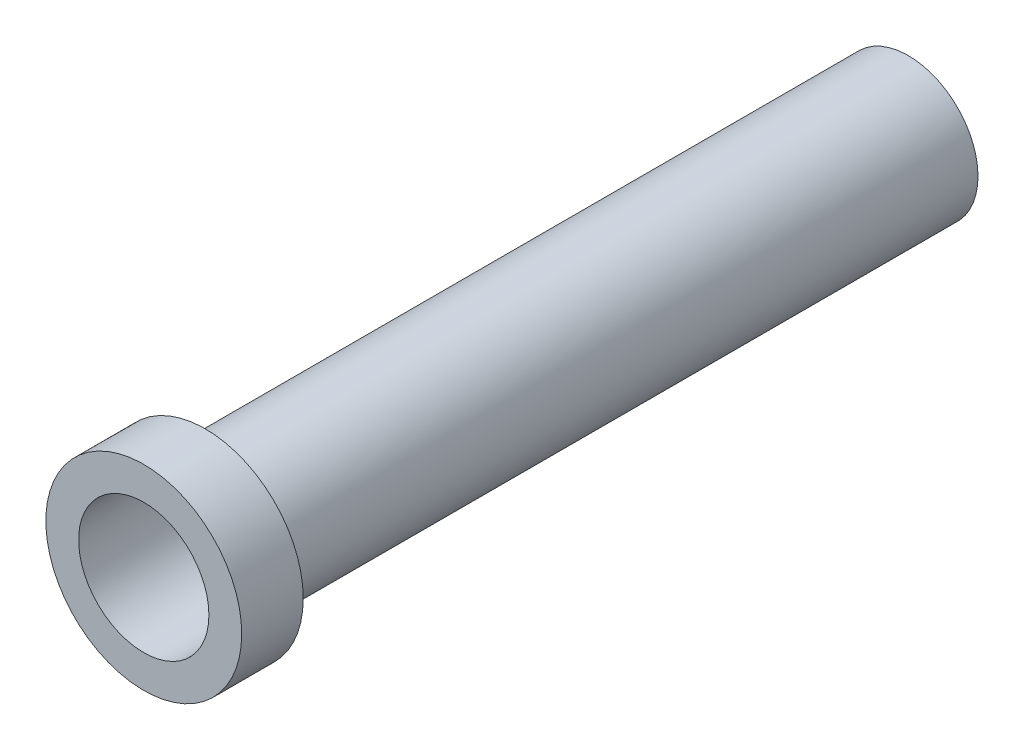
ISO-10303-21;
HEADER;
FILE_DESCRIPTION(('STEP AP214'),'2;1');
FILE_NAME('part.step','',(''),(''),'','','');
FILE_SCHEMA(('AUTOMOTIVE_DESIGN { 1 0 10303 214 1 1 1 1 }'));
ENDSEC;
DATA;
#1=APPLICATION_CONTEXT('core data for automotive mechanical design processes');
#2=APPLICATION_PROTOCOL_DEFINITION('international standard','automotive_design',2000,#1);
#3=PRODUCT_CONTEXT('',#1,'mechanical');
#4=PRODUCT('Part','Part','',(#3));
#5=PRODUCT_RELATED_PRODUCT_CATEGORY('part','',(#4));
#6=PRODUCT_DEFINITION_FORMATION('','',#4);
#7=PRODUCT_DEFINITION_CONTEXT('part definition',#1,'design');
#8=PRODUCT_DEFINITION('design','',#6,#7);
#9=PRODUCT_DEFINITION_SHAPE('','',#8);
#10=(LENGTH_UNIT() NAMED_UNIT(*) SI_UNIT(.MILLI.,.METRE.));
#11=(NAMED_UNIT(*) PLANE_ANGLE_UNIT() SI_UNIT($,.RADIAN.));
#12=(NAMED_UNIT(*) SI_UNIT($,.STERADIAN.) SOLID_ANGLE_UNIT());
#13=UNCERTAINTY_MEASURE_WITH_UNIT(LENGTH_MEASURE(1.E-05),#10,'distance_accuracy_value','');
#14=(GEOMETRIC_REPRESENTATION_CONTEXT(3) GLOBAL_UNCERTAINTY_ASSIGNED_CONTEXT((#13)) GLOBAL_UNIT_ASSIGNED_CONTEXT((#10,
#11,#12)) REPRESENTATION_CONTEXT('',''));
#15=CARTESIAN_POINT('',(0.,0.,0.));
#16=DIRECTION('',(0.,0.,1.));
#17=DIRECTION('',(1.,0.,0.));
#18=AXIS2_PLACEMENT_3D('',#15,#16,#17);
#19=CARTESIAN_POINT('',(0.,0.,295.91));
#20=DIRECTION('',(0.,0.,-1.));
#21=DIRECTION('',(-1.,0.,0.));
#22=AXIS2_PLACEMENT_3D('',#19,#20,#21);
#23=CYLINDRICAL_SURFACE('',#22,26.9875);
#24=CARTESIAN_POINT('',(0.,0.,0.));
#25=DIRECTION('',(0.,0.,1.));
#26=DIRECTION('',(1.,0.,0.));
#27=AXIS2_PLACEMENT_3D('',#24,#25,#26);
#28=CIRCLE('',#27,26.9875);
#29=CARTESIAN_POINT('',(26.9875,0.,0.));
#30=VERTEX_POINT('',#29);
#31=EDGE_CURVE('E37',#30,#30,#28,.T.);
#32=ORIENTED_EDGE('',*,*,#31,.T.);
#33=EDGE_LOOP('',(#32));
#34=FACE_BOUND('',#33,.T.);
#35=CARTESIAN_POINT('',(0.,0.,272.0975));
#36=DIRECTION('',(0.,0.,1.));
#37=DIRECTION('',(1.,0.,0.));
#38=AXIS2_PLACEMENT_3D('',#35,#36,#37);
#39=CIRCLE('',#38,26.9875);
#40=CARTESIAN_POINT('',(26.9875,0.,272.0975));
#41=VERTEX_POINT('',#40);
#42=EDGE_CURVE('E10',#41,#41,#39,.T.);
#43=ORIENTED_EDGE('',*,*,#42,.F.);
#44=EDGE_LOOP('',(#43));
#45=FACE_BOUND('',#44,.T.);
#46=ADVANCED_FACE('F34',(#34,#45),#23,.T.);
#47=CARTESIAN_POINT('',(0.,0.,295.91));
#48=DIRECTION('',(0.,0.,1.));
#49=DIRECTION('',(1.,0.,0.));
#50=AXIS2_PLACEMENT_3D('',#47,#48,#49);
#51=PLANE('',#50);
#52=CARTESIAN_POINT('',(0.,0.,295.91));
#53=DIRECTION('',(0.,0.,1.));
#54=DIRECTION('',(1.,0.,0.));
#55=AXIS2_PLACEMENT_3D('',#52,#53,#54);
#56=CIRCLE('',#55,25.2095);
#57=CARTESIAN_POINT('',(25.2095,0.,295.91));
#58=VERTEX_POINT('',#57);
#59=EDGE_CURVE('E45',#58,#58,#56,.T.);
#60=ORIENTED_EDGE('',*,*,#59,.F.);
#61=EDGE_LOOP('',(#60));
#62=FACE_BOUND('',#61,.T.);
#63=CARTESIAN_POINT('',(0.,0.,295.91));
#64=DIRECTION('',(0.,0.,1.));
#65=DIRECTION('',(1.,0.,0.));
#66=AXIS2_PLACEMENT_3D('',#63,#64,#65);
#67=CIRCLE('',#66,37.9095);
#68=CARTESIAN_POINT('',(37.9095,0.,295.91));
#69=VERTEX_POINT('',#68);
#70=EDGE_CURVE('E48',#69,#69,#67,.T.);
#71=ORIENTED_EDGE('',*,*,#70,.T.);
#72=EDGE_LOOP('',(#71));
#73=FACE_BOUND('',#72,.T.);
#74=ADVANCED_FACE('F62',(#62,#73),#51,.T.);
#75=CARTESIAN_POINT('',(0.,0.,0.));
#76=DIRECTION('',(0.,0.,1.));
#77=DIRECTION('',(1.,0.,0.));
#78=AXIS2_PLACEMENT_3D('',#75,#76,#77);
#79=PLANE('',#78);
#80=ORIENTED_EDGE('',*,*,#31,.F.);
#81=EDGE_LOOP('',(#80));
#82=FACE_BOUND('',#81,.T.);
#83=CARTESIAN_POINT('',(0.,0.,0.));
#84=DIRECTION('',(0.,0.,1.));
#85=DIRECTION('',(1.,0.,0.));
#86=AXIS2_PLACEMENT_3D('',#83,#84,#85);
#87=CIRCLE('',#86,25.2095);
#88=CARTESIAN_POINT('',(25.2095,0.,0.));
#89=VERTEX_POINT('',#88);
#90=EDGE_CURVE('E51',#89,#89,#87,.T.);
#91=ORIENTED_EDGE('',*,*,#90,.T.);
#92=EDGE_LOOP('',(#91));
#93=FACE_BOUND('',#92,.T.);
#94=ADVANCED_FACE('F80',(#82,#93),#79,.F.);
#95=CARTESIAN_POINT('',(0.,0.,295.91));
#96=DIRECTION('',(0.,0.,-1.));
#97=DIRECTION('',(-1.,0.,0.));
#98=AXIS2_PLACEMENT_3D('',#95,#96,#97);
#99=CYLINDRICAL_SURFACE('',#98,25.2095);
#100=ORIENTED_EDGE('',*,*,#59,.T.);
#101=EDGE_LOOP('',(#100));
#102=FACE_BOUND('',#101,.T.);
#103=ORIENTED_EDGE('',*,*,#90,.F.);
#104=EDGE_LOOP('',(#103));
#105=FACE_BOUND('',#104,.T.);
#106=ADVANCED_FACE('F71',(#102,#105),#99,.F.);
#107=CARTESIAN_POINT('',(0.,0.,272.0975));
#108=DIRECTION('',(0.,0.,1.));
#109=DIRECTION('',(1.,0.,0.));
#110=AXIS2_PLACEMENT_3D('',#107,#108,#109);
#111=PLANE('',#110);
#112=CARTESIAN_POINT('',(0.,0.,272.0975));
#113=DIRECTION('',(0.,0.,1.));
#114=DIRECTION('',(1.,0.,0.));
#115=AXIS2_PLACEMENT_3D('',#112,#113,#114);
#116=CIRCLE('',#115,37.9095);
#117=CARTESIAN_POINT('',(37.9095,0.,272.0975));
#118=VERTEX_POINT('',#117);
#119=EDGE_CURVE('E53',#118,#118,#116,.T.);
#120=ORIENTED_EDGE('',*,*,#119,.F.);
#121=EDGE_LOOP('',(#120));
#122=FACE_BOUND('',#121,.T.);
#123=ORIENTED_EDGE('',*,*,#42,.T.);
#124=EDGE_LOOP('',(#123));
#125=FACE_BOUND('',#124,.T.);
#126=ADVANCED_FACE('F66',(#122,#125),#111,.F.);
#127=CARTESIAN_POINT('',(0.,0.,272.0975));
#128=DIRECTION('',(0.,0.,1.));
#129=DIRECTION('',(1.,0.,0.));
#130=AXIS2_PLACEMENT_3D('',#127,#128,#129);
#131=CYLINDRICAL_SURFACE('',#130,37.9095);
#132=ORIENTED_EDGE('',*,*,#119,.T.);
#133=EDGE_LOOP('',(#132));
#134=FACE_BOUND('',#133,.T.);
#135=ORIENTED_EDGE('',*,*,#70,.F.);
#136=EDGE_LOOP('',(#135));
#137=FACE_BOUND('',#136,.T.);
#138=ADVANCED_FACE('F64',(#134,#137),#131,.T.);
#139=CLOSED_SHELL('',(#46,#74,#94,#106,#126,#138));
#140=MANIFOLD_SOLID_BREP('B2',#139);
#141=ADVANCED_BREP_SHAPE_REPRESENTATION('',(#18,#140),#14);
#142=SHAPE_DEFINITION_REPRESENTATION(#9,#141);
ENDSEC;
END-ISO-10303-21;
